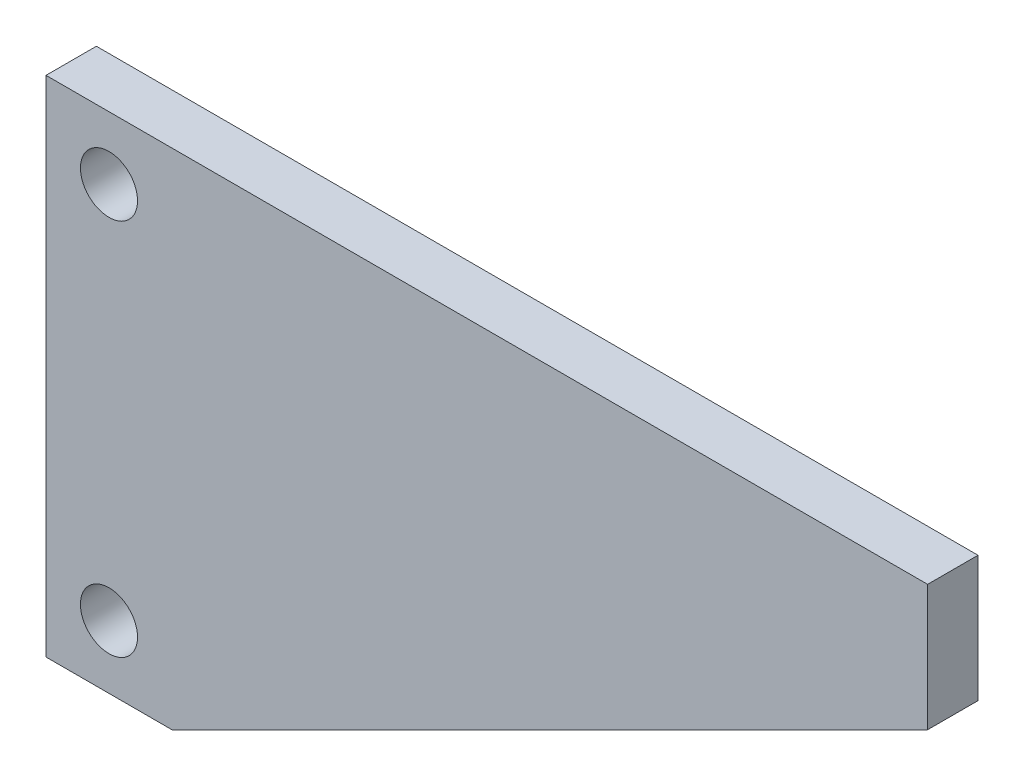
ISO-10303-21;
HEADER;
FILE_DESCRIPTION(('STEP AP214'),'2;1');
FILE_NAME('part.step','',(''),(''),'','','');
FILE_SCHEMA(('AUTOMOTIVE_DESIGN { 1 0 10303 214 1 1 1 1 }'));
ENDSEC;
DATA;
#1=APPLICATION_CONTEXT('core data for automotive mechanical design processes');
#2=APPLICATION_PROTOCOL_DEFINITION('international standard','automotive_design',2000,#1);
#3=PRODUCT_CONTEXT('',#1,'mechanical');
#4=PRODUCT('Part','Part','',(#3));
#5=PRODUCT_RELATED_PRODUCT_CATEGORY('part','',(#4));
#6=PRODUCT_DEFINITION_FORMATION('','',#4);
#7=PRODUCT_DEFINITION_CONTEXT('part definition',#1,'design');
#8=PRODUCT_DEFINITION('design','',#6,#7);
#9=PRODUCT_DEFINITION_SHAPE('','',#8);
#10=(LENGTH_UNIT() NAMED_UNIT(*) SI_UNIT(.MILLI.,.METRE.));
#11=(NAMED_UNIT(*) PLANE_ANGLE_UNIT() SI_UNIT($,.RADIAN.));
#12=(NAMED_UNIT(*) SI_UNIT($,.STERADIAN.) SOLID_ANGLE_UNIT());
#13=UNCERTAINTY_MEASURE_WITH_UNIT(LENGTH_MEASURE(1.E-05),#10,'distance_accuracy_value','');
#14=(GEOMETRIC_REPRESENTATION_CONTEXT(3) GLOBAL_UNCERTAINTY_ASSIGNED_CONTEXT((#13)) GLOBAL_UNIT_ASSIGNED_CONTEXT((#10,
#11,#12)) REPRESENTATION_CONTEXT('',''));
#15=CARTESIAN_POINT('',(0.,0.,0.));
#16=DIRECTION('',(0.,0.,1.));
#17=DIRECTION('',(1.,0.,0.));
#18=AXIS2_PLACEMENT_3D('',#15,#16,#17);
#19=CARTESIAN_POINT('',(0.,0.,5.));
#20=DIRECTION('',(1.,0.,0.));
#21=DIRECTION('',(0.,0.,-1.));
#22=AXIS2_PLACEMENT_3D('',#19,#20,#21);
#23=PLANE('',#22);
#24=DIRECTION('',(0.,-1.,0.));
#25=VECTOR('',#24,1.);
#26=CARTESIAN_POINT('',(0.,0.,-5.));
#27=LINE('',#26,#25);
#28=CARTESIAN_POINT('',(0.,100.,-5.));
#29=VERTEX_POINT('',#28);
#30=CARTESIAN_POINT('',(0.,0.,-5.));
#31=VERTEX_POINT('',#30);
#32=EDGE_CURVE('E115',#29,#31,#27,.T.);
#33=ORIENTED_EDGE('',*,*,#32,.T.);
#34=DIRECTION('',(0.,0.,-1.));
#35=VECTOR('',#34,1.);
#36=CARTESIAN_POINT('',(0.,0.,5.));
#37=LINE('',#36,#35);
#38=CARTESIAN_POINT('',(0.,0.,5.));
#39=VERTEX_POINT('',#38);
#40=EDGE_CURVE('E11',#39,#31,#37,.T.);
#41=ORIENTED_EDGE('',*,*,#40,.F.);
#42=DIRECTION('',(0.,-1.,0.));
#43=VECTOR('',#42,1.);
#44=CARTESIAN_POINT('',(0.,0.,5.));
#45=LINE('',#44,#43);
#46=CARTESIAN_POINT('',(0.,100.,5.));
#47=VERTEX_POINT('',#46);
#48=EDGE_CURVE('E124',#47,#39,#45,.T.);
#49=ORIENTED_EDGE('',*,*,#48,.F.);
#50=DIRECTION('',(0.,0.,-1.));
#51=VECTOR('',#50,1.);
#52=CARTESIAN_POINT('',(0.,100.,5.));
#53=LINE('',#52,#51);
#54=EDGE_CURVE('E111',#47,#29,#53,.T.);
#55=ORIENTED_EDGE('',*,*,#54,.T.);
#56=EDGE_LOOP('',(#33,#41,#49,#55));
#57=FACE_BOUND('',#56,.T.);
#58=ADVANCED_FACE('F41',(#57),#23,.F.);
#59=CARTESIAN_POINT('',(25.,0.,5.));
#60=DIRECTION('',(0.,1.,0.));
#61=DIRECTION('',(-1.,0.,0.));
#62=AXIS2_PLACEMENT_3D('',#59,#60,#61);
#63=PLANE('',#62);
#64=DIRECTION('',(1.,0.,0.));
#65=VECTOR('',#64,1.);
#66=CARTESIAN_POINT('',(25.,0.,-5.));
#67=LINE('',#66,#65);
#68=CARTESIAN_POINT('',(25.,0.,-5.));
#69=VERTEX_POINT('',#68);
#70=EDGE_CURVE('E118',#31,#69,#67,.T.);
#71=ORIENTED_EDGE('',*,*,#70,.T.);
#72=DIRECTION('',(0.,0.,-1.));
#73=VECTOR('',#72,1.);
#74=CARTESIAN_POINT('',(25.,0.,5.));
#75=LINE('',#74,#73);
#76=CARTESIAN_POINT('',(25.,0.,5.));
#77=VERTEX_POINT('',#76);
#78=EDGE_CURVE('E49',#77,#69,#75,.T.);
#79=ORIENTED_EDGE('',*,*,#78,.F.);
#80=DIRECTION('',(1.,0.,0.));
#81=VECTOR('',#80,1.);
#82=CARTESIAN_POINT('',(25.,0.,5.));
#83=LINE('',#82,#81);
#84=EDGE_CURVE('E91',#39,#77,#83,.T.);
#85=ORIENTED_EDGE('',*,*,#84,.F.);
#86=ORIENTED_EDGE('',*,*,#40,.T.);
#87=EDGE_LOOP('',(#71,#79,#85,#86));
#88=FACE_BOUND('',#87,.T.);
#89=ADVANCED_FACE('F144',(#88),#63,.F.);
#90=CARTESIAN_POINT('',(175.,75.,5.));
#91=DIRECTION('',(-0.447213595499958,0.894427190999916,0.));
#92=DIRECTION('',(-0.894427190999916,-0.447213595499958,0.));
#93=AXIS2_PLACEMENT_3D('',#90,#91,#92);
#94=PLANE('',#93);
#95=DIRECTION('',(0.894427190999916,0.447213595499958,0.));
#96=VECTOR('',#95,1.);
#97=CARTESIAN_POINT('',(175.,75.,-5.));
#98=LINE('',#97,#96);
#99=CARTESIAN_POINT('',(175.,75.,-5.));
#100=VERTEX_POINT('',#99);
#101=EDGE_CURVE('E106',#69,#100,#98,.T.);
#102=ORIENTED_EDGE('',*,*,#101,.T.);
#103=DIRECTION('',(0.,0.,-1.));
#104=VECTOR('',#103,1.);
#105=CARTESIAN_POINT('',(175.,75.,5.));
#106=LINE('',#105,#104);
#107=CARTESIAN_POINT('',(175.,75.,5.));
#108=VERTEX_POINT('',#107);
#109=EDGE_CURVE('E103',#108,#100,#106,.T.);
#110=ORIENTED_EDGE('',*,*,#109,.F.);
#111=DIRECTION('',(0.894427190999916,0.447213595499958,0.));
#112=VECTOR('',#111,1.);
#113=CARTESIAN_POINT('',(175.,75.,5.));
#114=LINE('',#113,#112);
#115=EDGE_CURVE('E95',#77,#108,#114,.T.);
#116=ORIENTED_EDGE('',*,*,#115,.F.);
#117=ORIENTED_EDGE('',*,*,#78,.T.);
#118=EDGE_LOOP('',(#102,#110,#116,#117));
#119=FACE_BOUND('',#118,.T.);
#120=ADVANCED_FACE('F104',(#119),#94,.F.);
#121=CARTESIAN_POINT('',(175.,100.,5.));
#122=DIRECTION('',(-1.,0.,0.));
#123=DIRECTION('',(0.,0.,1.));
#124=AXIS2_PLACEMENT_3D('',#121,#122,#123);
#125=PLANE('',#124);
#126=DIRECTION('',(0.,1.,0.));
#127=VECTOR('',#126,1.);
#128=CARTESIAN_POINT('',(175.,100.,-5.));
#129=LINE('',#128,#127);
#130=CARTESIAN_POINT('',(175.,100.,-5.));
#131=VERTEX_POINT('',#130);
#132=EDGE_CURVE('E77',#100,#131,#129,.T.);
#133=ORIENTED_EDGE('',*,*,#132,.T.);
#134=DIRECTION('',(0.,0.,-1.));
#135=VECTOR('',#134,1.);
#136=CARTESIAN_POINT('',(175.,100.,5.));
#137=LINE('',#136,#135);
#138=CARTESIAN_POINT('',(175.,100.,5.));
#139=VERTEX_POINT('',#138);
#140=EDGE_CURVE('E107',#139,#131,#137,.T.);
#141=ORIENTED_EDGE('',*,*,#140,.F.);
#142=DIRECTION('',(0.,1.,0.));
#143=VECTOR('',#142,1.);
#144=CARTESIAN_POINT('',(175.,100.,5.));
#145=LINE('',#144,#143);
#146=EDGE_CURVE('E99',#108,#139,#145,.T.);
#147=ORIENTED_EDGE('',*,*,#146,.F.);
#148=ORIENTED_EDGE('',*,*,#109,.T.);
#149=EDGE_LOOP('',(#133,#141,#147,#148));
#150=FACE_BOUND('',#149,.T.);
#151=ADVANCED_FACE('F109',(#150),#125,.F.);
#152=CARTESIAN_POINT('',(0.,100.,5.));
#153=DIRECTION('',(0.,-1.,0.));
#154=DIRECTION('',(0.,0.,-1.));
#155=AXIS2_PLACEMENT_3D('',#152,#153,#154);
#156=PLANE('',#155);
#157=DIRECTION('',(-1.,0.,0.));
#158=VECTOR('',#157,1.);
#159=CARTESIAN_POINT('',(0.,100.,-5.));
#160=LINE('',#159,#158);
#161=EDGE_CURVE('E83',#131,#29,#160,.T.);
#162=ORIENTED_EDGE('',*,*,#161,.T.);
#163=ORIENTED_EDGE('',*,*,#54,.F.);
#164=DIRECTION('',(-1.,0.,0.));
#165=VECTOR('',#164,1.);
#166=CARTESIAN_POINT('',(0.,100.,5.));
#167=LINE('',#166,#165);
#168=EDGE_CURVE('E57',#139,#47,#167,.T.);
#169=ORIENTED_EDGE('',*,*,#168,.F.);
#170=ORIENTED_EDGE('',*,*,#140,.T.);
#171=EDGE_LOOP('',(#162,#163,#169,#170));
#172=FACE_BOUND('',#171,.T.);
#173=ADVANCED_FACE('F132',(#172),#156,.F.);
#174=CARTESIAN_POINT('',(0.,100.,5.));
#175=DIRECTION('',(0.,0.,-1.));
#176=DIRECTION('',(-1.,0.,0.));
#177=AXIS2_PLACEMENT_3D('',#174,#175,#176);
#178=PLANE('',#177);
#179=CARTESIAN_POINT('',(12.5,87.5,5.));
#180=DIRECTION('',(0.,0.,1.));
#181=DIRECTION('',(1.,0.,0.));
#182=AXIS2_PLACEMENT_3D('',#179,#180,#181);
#183=CIRCLE('',#182,5.66755120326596);
#184=CARTESIAN_POINT('',(18.167551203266,87.5,5.));
#185=VERTEX_POINT('',#184);
#186=EDGE_CURVE('E206',#185,#185,#183,.T.);
#187=ORIENTED_EDGE('',*,*,#186,.F.);
#188=EDGE_LOOP('',(#187));
#189=FACE_BOUND('',#188,.T.);
#190=CARTESIAN_POINT('',(12.5,12.5,5.));
#191=DIRECTION('',(0.,0.,1.));
#192=DIRECTION('',(1.,0.,0.));
#193=AXIS2_PLACEMENT_3D('',#190,#191,#192);
#194=CIRCLE('',#193,5.66755120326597);
#195=CARTESIAN_POINT('',(18.167551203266,12.5,5.));
#196=VERTEX_POINT('',#195);
#197=EDGE_CURVE('E207',#196,#196,#194,.T.);
#198=ORIENTED_EDGE('',*,*,#197,.F.);
#199=EDGE_LOOP('',(#198));
#200=FACE_BOUND('',#199,.T.);
#201=ORIENTED_EDGE('',*,*,#48,.T.);
#202=ORIENTED_EDGE('',*,*,#84,.T.);
#203=ORIENTED_EDGE('',*,*,#115,.T.);
#204=ORIENTED_EDGE('',*,*,#146,.T.);
#205=ORIENTED_EDGE('',*,*,#168,.T.);
#206=EDGE_LOOP('',(#201,#202,#203,#204,#205));
#207=FACE_BOUND('',#206,.T.);
#208=ADVANCED_FACE('F97',(#189,#200,#207),#178,.F.);
#209=CARTESIAN_POINT('',(0.,100.,-5.));
#210=DIRECTION('',(0.,0.,-1.));
#211=DIRECTION('',(-1.,0.,0.));
#212=AXIS2_PLACEMENT_3D('',#209,#210,#211);
#213=PLANE('',#212);
#214=CARTESIAN_POINT('',(12.5,87.5,-5.));
#215=DIRECTION('',(0.,0.,1.));
#216=DIRECTION('',(1.,0.,0.));
#217=AXIS2_PLACEMENT_3D('',#214,#215,#216);
#218=CIRCLE('',#217,5.66755120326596);
#219=CARTESIAN_POINT('',(18.167551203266,87.5,-5.));
#220=VERTEX_POINT('',#219);
#221=EDGE_CURVE('E119',#220,#220,#218,.T.);
#222=ORIENTED_EDGE('',*,*,#221,.T.);
#223=EDGE_LOOP('',(#222));
#224=FACE_BOUND('',#223,.T.);
#225=CARTESIAN_POINT('',(12.5,12.5,-5.));
#226=DIRECTION('',(0.,0.,1.));
#227=DIRECTION('',(1.,0.,0.));
#228=AXIS2_PLACEMENT_3D('',#225,#226,#227);
#229=CIRCLE('',#228,5.66755120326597);
#230=CARTESIAN_POINT('',(18.167551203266,12.5,-5.));
#231=VERTEX_POINT('',#230);
#232=EDGE_CURVE('E211',#231,#231,#229,.T.);
#233=ORIENTED_EDGE('',*,*,#232,.T.);
#234=EDGE_LOOP('',(#233));
#235=FACE_BOUND('',#234,.T.);
#236=ORIENTED_EDGE('',*,*,#32,.F.);
#237=ORIENTED_EDGE('',*,*,#161,.F.);
#238=ORIENTED_EDGE('',*,*,#132,.F.);
#239=ORIENTED_EDGE('',*,*,#101,.F.);
#240=ORIENTED_EDGE('',*,*,#70,.F.);
#241=EDGE_LOOP('',(#236,#237,#238,#239,#240));
#242=FACE_BOUND('',#241,.T.);
#243=ADVANCED_FACE('F128',(#224,#235,#242),#213,.T.);
#244=CARTESIAN_POINT('',(12.5,12.5,-5.));
#245=DIRECTION('',(0.,0.,1.));
#246=DIRECTION('',(1.,0.,0.));
#247=AXIS2_PLACEMENT_3D('',#244,#245,#246);
#248=CYLINDRICAL_SURFACE('',#247,5.66755120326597);
#249=ORIENTED_EDGE('',*,*,#232,.F.);
#250=EDGE_LOOP('',(#249));
#251=FACE_BOUND('',#250,.T.);
#252=ORIENTED_EDGE('',*,*,#197,.T.);
#253=EDGE_LOOP('',(#252));
#254=FACE_BOUND('',#253,.T.);
#255=ADVANCED_FACE('F179',(#251,#254),#248,.F.);
#256=CARTESIAN_POINT('',(12.5,87.5,-5.));
#257=DIRECTION('',(0.,0.,1.));
#258=DIRECTION('',(1.,0.,0.));
#259=AXIS2_PLACEMENT_3D('',#256,#257,#258);
#260=CYLINDRICAL_SURFACE('',#259,5.66755120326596);
#261=ORIENTED_EDGE('',*,*,#221,.F.);
#262=EDGE_LOOP('',(#261));
#263=FACE_BOUND('',#262,.T.);
#264=ORIENTED_EDGE('',*,*,#186,.T.);
#265=EDGE_LOOP('',(#264));
#266=FACE_BOUND('',#265,.T.);
#267=ADVANCED_FACE('F188',(#263,#266),#260,.F.);
#268=CLOSED_SHELL('',(#58,#89,#120,#151,#173,#208,#243,#255,#267));
#269=MANIFOLD_SOLID_BREP('B2',#268);
#270=ADVANCED_BREP_SHAPE_REPRESENTATION('',(#18,#269),#14);
#271=SHAPE_DEFINITION_REPRESENTATION(#9,#270);
ENDSEC;
END-ISO-10303-21;
